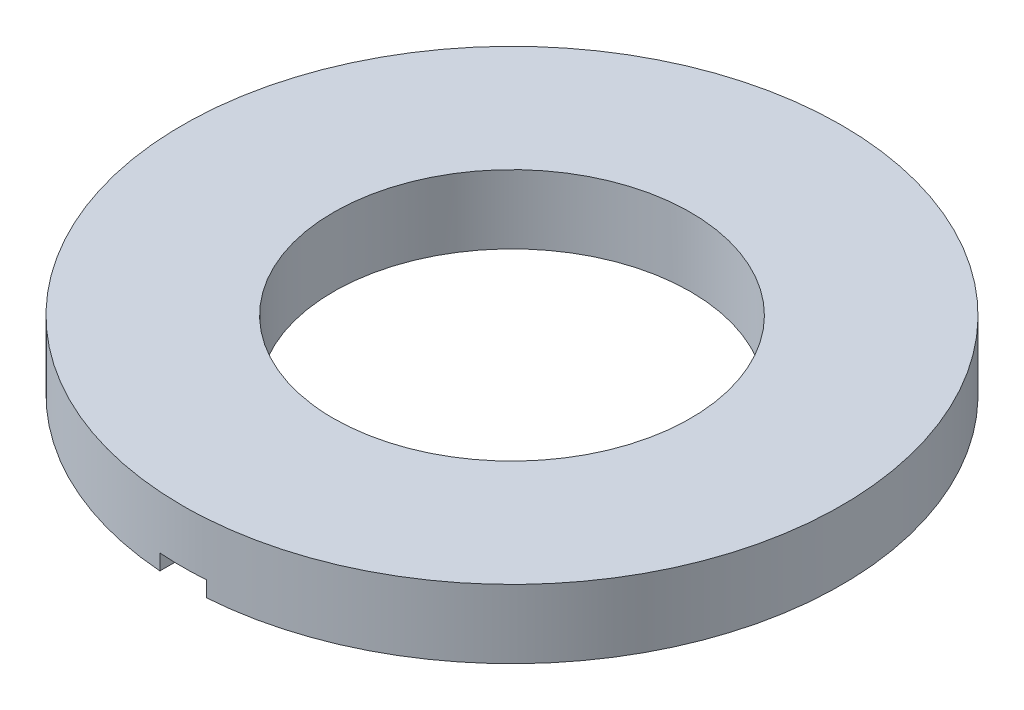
from build123d import *

# Parameters (mm, degrees)
SKETCH1_R          = 12
SKETCH1_R_2        = 6.5
EXTRUDE1_DEPTH     = 2.5
SKETCH2_W          = 1.7
SKETCH2_H          = 11
CUT_EXTRUDE1_DEPTH = 0.566666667


with BuildPart() as part:
    # Sketch1 → Extrude1 (new body)
    with BuildSketch(Plane(origin=(0, 0, 0), x_dir=(1, 0, 0), z_dir=(0, 1, 0))):
        with Locations(Location((0, 0, 0), (0, 0, 270))):
            Circle(SKETCH1_R)
        with Locations(Location((0, 0, 0), (0, 0, 270))):
            Circle(SKETCH1_R_2, mode=Mode.SUBTRACT)
    extrude(amount=EXTRUDE1_DEPTH)

    # Sketch2 → Cut-Extrude1 (cut)
    with BuildSketch(Plane.XZ):
        with Locations((0, 6.5)):
            Rectangle(SKETCH2_W, SKETCH2_H)
    extrude(amount=-CUT_EXTRUDE1_DEPTH, mode=Mode.SUBTRACT)


solid = part.part
